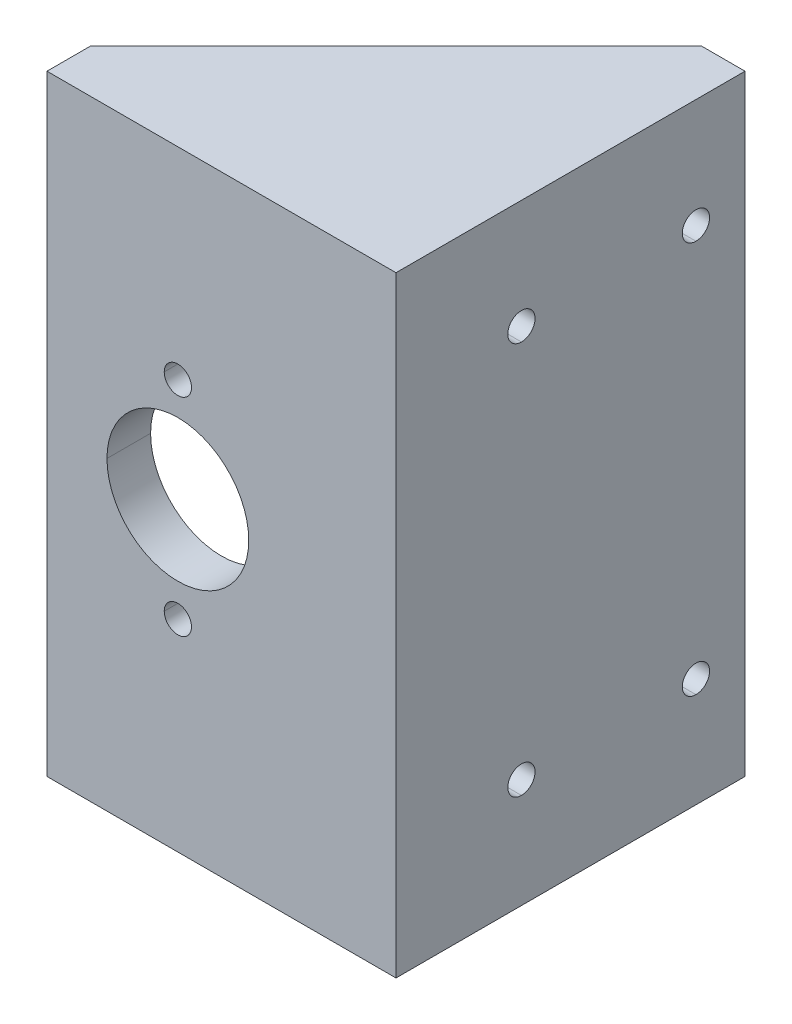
ISO-10303-21;
HEADER;
FILE_DESCRIPTION(('STEP AP214'),'2;1');
FILE_NAME('part.step','',(''),(''),'','','');
FILE_SCHEMA(('AUTOMOTIVE_DESIGN { 1 0 10303 214 1 1 1 1 }'));
ENDSEC;
DATA;
#1=APPLICATION_CONTEXT('core data for automotive mechanical design processes');
#2=APPLICATION_PROTOCOL_DEFINITION('international standard','automotive_design',2000,#1);
#3=PRODUCT_CONTEXT('',#1,'mechanical');
#4=PRODUCT('Part','Part','',(#3));
#5=PRODUCT_RELATED_PRODUCT_CATEGORY('part','',(#4));
#6=PRODUCT_DEFINITION_FORMATION('','',#4);
#7=PRODUCT_DEFINITION_CONTEXT('part definition',#1,'design');
#8=PRODUCT_DEFINITION('design','',#6,#7);
#9=PRODUCT_DEFINITION_SHAPE('','',#8);
#10=(LENGTH_UNIT() NAMED_UNIT(*) SI_UNIT(.MILLI.,.METRE.));
#11=(NAMED_UNIT(*) PLANE_ANGLE_UNIT() SI_UNIT($,.RADIAN.));
#12=(NAMED_UNIT(*) SI_UNIT($,.STERADIAN.) SOLID_ANGLE_UNIT());
#13=UNCERTAINTY_MEASURE_WITH_UNIT(LENGTH_MEASURE(1.E-05),#10,'distance_accuracy_value','');
#14=(GEOMETRIC_REPRESENTATION_CONTEXT(3) GLOBAL_UNCERTAINTY_ASSIGNED_CONTEXT((#13)) GLOBAL_UNIT_ASSIGNED_CONTEXT((#10,
#11,#12)) REPRESENTATION_CONTEXT('',''));
#15=CARTESIAN_POINT('',(0.,0.,0.));
#16=DIRECTION('',(0.,0.,1.));
#17=DIRECTION('',(1.,0.,0.));
#18=AXIS2_PLACEMENT_3D('',#15,#16,#17);
#19=CARTESIAN_POINT('',(38.1,-76.2,25.4));
#20=DIRECTION('',(0.,-1.,0.));
#21=DIRECTION('',(0.,0.,-1.));
#22=AXIS2_PLACEMENT_3D('',#19,#20,#21);
#23=PLANE('',#22);
#24=DIRECTION('',(-1.,0.,0.));
#25=VECTOR('',#24,1.);
#26=CARTESIAN_POINT('',(38.1,-76.2,25.4));
#27=LINE('',#26,#25);
#28=CARTESIAN_POINT('',(-38.1,-76.2000000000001,25.4));
#29=VERTEX_POINT('',#28);
#30=CARTESIAN_POINT('',(38.1,-76.2000000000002,25.4));
#31=VERTEX_POINT('',#30);
#32=EDGE_CURVE('E176',#29,#31,#27,.F.);
#33=ORIENTED_EDGE('',*,*,#32,.T.);
#34=DIRECTION('',(0.,0.,1.));
#35=VECTOR('',#34,1.);
#36=CARTESIAN_POINT('',(38.1,-76.2000000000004,11.7700640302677));
#37=LINE('',#36,#35);
#38=CARTESIAN_POINT('',(38.1,-76.2000000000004,-50.8));
#39=VERTEX_POINT('',#38);
#40=EDGE_CURVE('E179',#39,#31,#37,.T.);
#41=ORIENTED_EDGE('',*,*,#40,.F.);
#42=DIRECTION('',(0.707106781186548,0.,-0.707106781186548));
#43=VECTOR('',#42,1.);
#44=CARTESIAN_POINT('',(-50.8,-76.2000000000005,38.1));
#45=LINE('',#44,#43);
#46=EDGE_CURVE('E174',#39,#29,#45,.F.);
#47=ORIENTED_EDGE('',*,*,#46,.T.);
#48=EDGE_LOOP('',(#33,#41,#47));
#49=FACE_BOUND('',#48,.T.);
#50=ADVANCED_FACE('F16',(#49),#23,.F.);
#51=CARTESIAN_POINT('',(38.1,-63.5,25.4));
#52=DIRECTION('',(-1.,0.,0.));
#53=DIRECTION('',(0.,0.,1.));
#54=AXIS2_PLACEMENT_3D('',#51,#52,#53);
#55=CYLINDRICAL_SURFACE('',#54,12.7);
#56=DIRECTION('',(1.,0.,0.));
#57=VECTOR('',#56,1.);
#58=CARTESIAN_POINT('',(38.1,-63.5,38.1));
#59=LINE('',#58,#57);
#60=CARTESIAN_POINT('',(-50.8,-63.5,38.1));
#61=VERTEX_POINT('',#60);
#62=CARTESIAN_POINT('',(38.1,-63.5,38.1));
#63=VERTEX_POINT('',#62);
#64=EDGE_CURVE('E233',#61,#63,#59,.T.);
#65=ORIENTED_EDGE('',*,*,#64,.T.);
#66=CARTESIAN_POINT('',(38.1,-63.5,25.4));
#67=DIRECTION('',(-1.,0.,0.));
#68=DIRECTION('',(0.,0.,1.));
#69=AXIS2_PLACEMENT_3D('',#66,#67,#68);
#70=CIRCLE('',#69,12.7);
#71=EDGE_CURVE('E191',#31,#63,#70,.T.);
#72=ORIENTED_EDGE('',*,*,#71,.F.);
#73=ORIENTED_EDGE('',*,*,#32,.F.);
#74=CARTESIAN_POINT('',(-38.1,-63.5,25.4));
#75=DIRECTION('',(0.707106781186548,0.,0.707106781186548));
#76=DIRECTION('',(-0.707106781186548,0.,0.707106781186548));
#77=AXIS2_PLACEMENT_3D('',#74,#75,#76);
#78=ELLIPSE('',#77,17.9605122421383,12.7);
#79=EDGE_CURVE('E19',#29,#61,#78,.F.);
#80=ORIENTED_EDGE('',*,*,#79,.T.);
#81=EDGE_LOOP('',(#65,#72,#73,#80));
#82=FACE_BOUND('',#81,.T.);
#83=ADVANCED_FACE('F188',(#82),#55,.F.);
#84=CARTESIAN_POINT('',(38.1,76.1999999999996,-50.8));
#85=DIRECTION('',(0.,1.,0.));
#86=DIRECTION('',(0.,0.,1.));
#87=AXIS2_PLACEMENT_3D('',#84,#85,#86);
#88=PLANE('',#87);
#89=DIRECTION('',(0.,0.,1.));
#90=VECTOR('',#89,1.);
#91=CARTESIAN_POINT('',(38.1,76.1999999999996,11.7700640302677));
#92=LINE('',#91,#90);
#93=CARTESIAN_POINT('',(38.1,76.1999999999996,25.4));
#94=VERTEX_POINT('',#93);
#95=CARTESIAN_POINT('',(38.1,76.1999999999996,-50.8));
#96=VERTEX_POINT('',#95);
#97=EDGE_CURVE('E205',#94,#96,#92,.F.);
#98=ORIENTED_EDGE('',*,*,#97,.F.);
#99=DIRECTION('',(-1.,0.,0.));
#100=VECTOR('',#99,1.);
#101=CARTESIAN_POINT('',(38.1,76.1999999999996,25.4));
#102=LINE('',#101,#100);
#103=CARTESIAN_POINT('',(-38.1,76.1999999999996,25.4));
#104=VERTEX_POINT('',#103);
#105=EDGE_CURVE('E192',#94,#104,#102,.T.);
#106=ORIENTED_EDGE('',*,*,#105,.T.);
#107=DIRECTION('',(0.707106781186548,0.,-0.707106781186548));
#108=VECTOR('',#107,1.);
#109=CARTESIAN_POINT('',(-50.8,76.1999999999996,38.1));
#110=LINE('',#109,#108);
#111=EDGE_CURVE('E350',#104,#96,#110,.T.);
#112=ORIENTED_EDGE('',*,*,#111,.T.);
#113=EDGE_LOOP('',(#98,#106,#112));
#114=FACE_BOUND('',#113,.T.);
#115=ADVANCED_FACE('F427',(#114),#88,.F.);
#116=CARTESIAN_POINT('',(38.1,63.4999999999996,25.4));
#117=DIRECTION('',(-1.,0.,0.));
#118=DIRECTION('',(0.,0.,1.));
#119=AXIS2_PLACEMENT_3D('',#116,#117,#118);
#120=CYLINDRICAL_SURFACE('',#119,12.7);
#121=ORIENTED_EDGE('',*,*,#105,.F.);
#122=CARTESIAN_POINT('',(38.1,63.4999999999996,25.4));
#123=DIRECTION('',(-1.,0.,0.));
#124=DIRECTION('',(0.,0.,1.));
#125=AXIS2_PLACEMENT_3D('',#122,#123,#124);
#126=CIRCLE('',#125,12.7);
#127=CARTESIAN_POINT('',(38.1,63.4999999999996,38.1));
#128=VERTEX_POINT('',#127);
#129=EDGE_CURVE('E200',#128,#94,#126,.T.);
#130=ORIENTED_EDGE('',*,*,#129,.F.);
#131=DIRECTION('',(1.,0.,0.));
#132=VECTOR('',#131,1.);
#133=CARTESIAN_POINT('',(38.1,63.4999999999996,38.1));
#134=LINE('',#133,#132);
#135=CARTESIAN_POINT('',(-50.8,63.4999999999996,38.1));
#136=VERTEX_POINT('',#135);
#137=EDGE_CURVE('E184',#128,#136,#134,.F.);
#138=ORIENTED_EDGE('',*,*,#137,.T.);
#139=CARTESIAN_POINT('',(-38.1,63.4999999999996,25.4));
#140=DIRECTION('',(0.707106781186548,0.,0.707106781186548));
#141=DIRECTION('',(-0.707106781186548,0.,0.707106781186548));
#142=AXIS2_PLACEMENT_3D('',#139,#140,#141);
#143=ELLIPSE('',#142,17.9605122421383,12.7);
#144=EDGE_CURVE('E236',#136,#104,#143,.F.);
#145=ORIENTED_EDGE('',*,*,#144,.T.);
#146=EDGE_LOOP('',(#121,#130,#138,#145));
#147=FACE_BOUND('',#146,.T.);
#148=ADVANCED_FACE('F422',(#147),#120,.F.);
#149=CARTESIAN_POINT('',(38.1,63.4999999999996,38.1));
#150=DIRECTION('',(0.,0.,1.));
#151=DIRECTION('',(1.,0.,0.));
#152=AXIS2_PLACEMENT_3D('',#149,#150,#151);
#153=PLANE('',#152);
#154=CARTESIAN_POINT('',(-12.7,-30.1625000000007,38.1));
#155=DIRECTION('',(0.,0.,1.));
#156=DIRECTION('',(1.,0.,0.));
#157=AXIS2_PLACEMENT_3D('',#154,#155,#156);
#158=CIRCLE('',#157,3.96875);
#159=CARTESIAN_POINT('',(-16.66875,-30.1625000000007,38.1));
#160=VERTEX_POINT('',#159);
#161=CARTESIAN_POINT('',(-8.73125,-30.1625000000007,38.1));
#162=VERTEX_POINT('',#161);
#163=EDGE_CURVE('E344',#160,#162,#158,.T.);
#164=ORIENTED_EDGE('',*,*,#163,.T.);
#165=CARTESIAN_POINT('',(-12.7,-30.1625000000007,38.1));
#166=DIRECTION('',(0.,0.,1.));
#167=DIRECTION('',(1.,0.,0.));
#168=AXIS2_PLACEMENT_3D('',#165,#166,#167);
#169=CIRCLE('',#168,3.96875);
#170=EDGE_CURVE('E217',#162,#160,#169,.T.);
#171=ORIENTED_EDGE('',*,*,#170,.T.);
#172=EDGE_LOOP('',(#164,#171));
#173=FACE_BOUND('',#172,.T.);
#174=CARTESIAN_POINT('',(-12.7,30.1624999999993,38.1));
#175=DIRECTION('',(0.,0.,1.));
#176=DIRECTION('',(1.,0.,0.));
#177=AXIS2_PLACEMENT_3D('',#174,#175,#176);
#178=CIRCLE('',#177,3.96875);
#179=CARTESIAN_POINT('',(-16.66875,30.1624999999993,38.1));
#180=VERTEX_POINT('',#179);
#181=CARTESIAN_POINT('',(-8.73125,30.1624999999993,38.1));
#182=VERTEX_POINT('',#181);
#183=EDGE_CURVE('E338',#180,#182,#178,.T.);
#184=ORIENTED_EDGE('',*,*,#183,.T.);
#185=CARTESIAN_POINT('',(-12.7,30.1624999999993,38.1));
#186=DIRECTION('',(0.,0.,1.));
#187=DIRECTION('',(1.,0.,0.));
#188=AXIS2_PLACEMENT_3D('',#185,#186,#187);
#189=CIRCLE('',#188,3.96875);
#190=EDGE_CURVE('E341',#182,#180,#189,.T.);
#191=ORIENTED_EDGE('',*,*,#190,.T.);
#192=EDGE_LOOP('',(#184,#191));
#193=FACE_BOUND('',#192,.T.);
#194=CARTESIAN_POINT('',(-12.7,-7.21911419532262E-13,38.1));
#195=DIRECTION('',(0.,0.,1.));
#196=DIRECTION('',(1.,0.,0.));
#197=AXIS2_PLACEMENT_3D('',#194,#195,#196);
#198=CIRCLE('',#197,20.6375);
#199=CARTESIAN_POINT('',(7.9375,-7.24438700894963E-13,38.1));
#200=VERTEX_POINT('',#199);
#201=CARTESIAN_POINT('',(-33.3375,-7.19384138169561E-13,38.1));
#202=VERTEX_POINT('',#201);
#203=EDGE_CURVE('E335',#200,#202,#198,.T.);
#204=ORIENTED_EDGE('',*,*,#203,.T.);
#205=CARTESIAN_POINT('',(-12.7,-7.21911419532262E-13,38.1));
#206=DIRECTION('',(0.,0.,1.));
#207=DIRECTION('',(1.,0.,0.));
#208=AXIS2_PLACEMENT_3D('',#205,#206,#207);
#209=CIRCLE('',#208,20.6375);
#210=EDGE_CURVE('E332',#202,#200,#209,.T.);
#211=ORIENTED_EDGE('',*,*,#210,.T.);
#212=EDGE_LOOP('',(#204,#211));
#213=FACE_BOUND('',#212,.T.);
#214=ORIENTED_EDGE('',*,*,#137,.F.);
#215=DIRECTION('',(0.,1.,0.));
#216=VECTOR('',#215,1.);
#217=CARTESIAN_POINT('',(38.1,-3.60955709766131E-13,38.1));
#218=LINE('',#217,#216);
#219=EDGE_CURVE('E198',#63,#128,#218,.T.);
#220=ORIENTED_EDGE('',*,*,#219,.F.);
#221=ORIENTED_EDGE('',*,*,#64,.F.);
#222=DIRECTION('',(0.,1.,0.));
#223=VECTOR('',#222,1.);
#224=CARTESIAN_POINT('',(-50.8,114.3,38.1));
#225=LINE('',#224,#223);
#226=EDGE_CURVE('E212',#61,#136,#225,.T.);
#227=ORIENTED_EDGE('',*,*,#226,.T.);
#228=EDGE_LOOP('',(#214,#220,#221,#227));
#229=FACE_BOUND('',#228,.T.);
#230=ADVANCED_FACE('F419',(#173,#193,#213,#229),#153,.F.);
#231=CARTESIAN_POINT('',(-50.8,114.3,38.1));
#232=DIRECTION('',(0.707106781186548,0.,0.707106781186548));
#233=DIRECTION('',(0.707106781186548,0.,-0.707106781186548));
#234=AXIS2_PLACEMENT_3D('',#231,#232,#233);
#235=PLANE('',#234);
#236=ORIENTED_EDGE('',*,*,#46,.F.);
#237=DIRECTION('',(0.,1.,0.));
#238=VECTOR('',#237,1.);
#239=CARTESIAN_POINT('',(38.1,-76.2,-50.8));
#240=LINE('',#239,#238);
#241=CARTESIAN_POINT('',(38.1,-88.9,-50.8));
#242=VERTEX_POINT('',#241);
#243=EDGE_CURVE('E258',#242,#39,#240,.T.);
#244=ORIENTED_EDGE('',*,*,#243,.F.);
#245=DIRECTION('',(0.707106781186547,0.,-0.707106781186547));
#246=VECTOR('',#245,1.);
#247=CARTESIAN_POINT('',(-50.8,-88.9,38.1));
#248=LINE('',#247,#246);
#249=CARTESIAN_POINT('',(-50.8,-88.9,38.1));
#250=VERTEX_POINT('',#249);
#251=EDGE_CURVE('E239',#250,#242,#248,.T.);
#252=ORIENTED_EDGE('',*,*,#251,.F.);
#253=DIRECTION('',(0.,1.,0.));
#254=VECTOR('',#253,1.);
#255=CARTESIAN_POINT('',(-50.8,114.3,38.1));
#256=LINE('',#255,#254);
#257=EDGE_CURVE('E196',#250,#61,#256,.T.);
#258=ORIENTED_EDGE('',*,*,#257,.T.);
#259=ORIENTED_EDGE('',*,*,#79,.F.);
#260=EDGE_LOOP('',(#236,#244,#252,#258,#259));
#261=FACE_BOUND('',#260,.T.);
#262=ADVANCED_FACE('F194',(#261),#235,.F.);
#263=CARTESIAN_POINT('',(38.1,-3.60955709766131E-13,11.7700640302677));
#264=DIRECTION('',(-1.,0.,0.));
#265=DIRECTION('',(0.,0.,1.));
#266=AXIS2_PLACEMENT_3D('',#263,#264,#265);
#267=PLANE('',#266);
#268=ORIENTED_EDGE('',*,*,#40,.T.);
#269=ORIENTED_EDGE('',*,*,#71,.T.);
#270=ORIENTED_EDGE('',*,*,#219,.T.);
#271=ORIENTED_EDGE('',*,*,#129,.T.);
#272=ORIENTED_EDGE('',*,*,#97,.T.);
#273=DIRECTION('',(0.,1.,0.));
#274=VECTOR('',#273,1.);
#275=CARTESIAN_POINT('',(38.1,-76.2,-50.8));
#276=LINE('',#275,#274);
#277=EDGE_CURVE('E255',#39,#96,#276,.T.);
#278=ORIENTED_EDGE('',*,*,#277,.F.);
#279=EDGE_LOOP('',(#268,#269,#270,#271,#272,#278));
#280=FACE_BOUND('',#279,.T.);
#281=CARTESIAN_POINT('',(38.1,-57.15,-36.5125));
#282=DIRECTION('',(-1.,0.,0.));
#283=DIRECTION('',(0.,0.,1.));
#284=AXIS2_PLACEMENT_3D('',#281,#282,#283);
#285=CIRCLE('',#284,3.96875);
#286=CARTESIAN_POINT('',(38.1,-61.11875,-36.5125));
#287=VERTEX_POINT('',#286);
#288=CARTESIAN_POINT('',(38.1,-53.18125,-36.5125));
#289=VERTEX_POINT('',#288);
#290=EDGE_CURVE('E308',#287,#289,#285,.F.);
#291=ORIENTED_EDGE('',*,*,#290,.T.);
#292=CARTESIAN_POINT('',(38.1,-57.15,-36.5125));
#293=DIRECTION('',(-1.,0.,0.));
#294=DIRECTION('',(0.,0.,1.));
#295=AXIS2_PLACEMENT_3D('',#292,#293,#294);
#296=CIRCLE('',#295,3.96875);
#297=EDGE_CURVE('E311',#289,#287,#296,.F.);
#298=ORIENTED_EDGE('',*,*,#297,.T.);
#299=EDGE_LOOP('',(#291,#298));
#300=FACE_BOUND('',#299,.T.);
#301=CARTESIAN_POINT('',(38.1,-57.15,14.2875));
#302=DIRECTION('',(-1.,0.,0.));
#303=DIRECTION('',(0.,0.,1.));
#304=AXIS2_PLACEMENT_3D('',#301,#302,#303);
#305=CIRCLE('',#304,3.96875);
#306=CARTESIAN_POINT('',(38.1,-61.11875,14.2875));
#307=VERTEX_POINT('',#306);
#308=CARTESIAN_POINT('',(38.1,-53.18125,14.2875));
#309=VERTEX_POINT('',#308);
#310=EDGE_CURVE('E314',#307,#309,#305,.F.);
#311=ORIENTED_EDGE('',*,*,#310,.T.);
#312=CARTESIAN_POINT('',(38.1,-57.15,14.2875));
#313=DIRECTION('',(-1.,0.,0.));
#314=DIRECTION('',(0.,0.,1.));
#315=AXIS2_PLACEMENT_3D('',#312,#313,#314);
#316=CIRCLE('',#315,3.96875);
#317=EDGE_CURVE('E317',#309,#307,#316,.F.);
#318=ORIENTED_EDGE('',*,*,#317,.T.);
#319=EDGE_LOOP('',(#311,#318));
#320=FACE_BOUND('',#319,.T.);
#321=CARTESIAN_POINT('',(38.1,57.1500000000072,14.2875));
#322=DIRECTION('',(-1.,0.,0.));
#323=DIRECTION('',(0.,0.,1.));
#324=AXIS2_PLACEMENT_3D('',#321,#322,#323);
#325=CIRCLE('',#324,3.96875);
#326=CARTESIAN_POINT('',(38.1,53.1812500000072,14.2875));
#327=VERTEX_POINT('',#326);
#328=CARTESIAN_POINT('',(38.1,61.1187500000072,14.2875));
#329=VERTEX_POINT('',#328);
#330=EDGE_CURVE('E320',#327,#329,#325,.F.);
#331=ORIENTED_EDGE('',*,*,#330,.T.);
#332=CARTESIAN_POINT('',(38.1,57.1500000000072,14.2875));
#333=DIRECTION('',(-1.,0.,0.));
#334=DIRECTION('',(0.,0.,1.));
#335=AXIS2_PLACEMENT_3D('',#332,#333,#334);
#336=CIRCLE('',#335,3.96875);
#337=EDGE_CURVE('E323',#329,#327,#336,.F.);
#338=ORIENTED_EDGE('',*,*,#337,.T.);
#339=EDGE_LOOP('',(#331,#338));
#340=FACE_BOUND('',#339,.T.);
#341=CARTESIAN_POINT('',(38.1,57.1500000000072,-36.5125));
#342=DIRECTION('',(-1.,0.,0.));
#343=DIRECTION('',(0.,0.,1.));
#344=AXIS2_PLACEMENT_3D('',#341,#342,#343);
#345=CIRCLE('',#344,3.96875);
#346=CARTESIAN_POINT('',(38.1,53.1812500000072,-36.5125));
#347=VERTEX_POINT('',#346);
#348=CARTESIAN_POINT('',(38.1,61.1187500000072,-36.5125));
#349=VERTEX_POINT('',#348);
#350=EDGE_CURVE('E326',#347,#349,#345,.F.);
#351=ORIENTED_EDGE('',*,*,#350,.T.);
#352=CARTESIAN_POINT('',(38.1,57.1500000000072,-36.5125));
#353=DIRECTION('',(-1.,0.,0.));
#354=DIRECTION('',(0.,0.,1.));
#355=AXIS2_PLACEMENT_3D('',#352,#353,#354);
#356=CIRCLE('',#355,3.96875);
#357=EDGE_CURVE('E329',#349,#347,#356,.F.);
#358=ORIENTED_EDGE('',*,*,#357,.T.);
#359=EDGE_LOOP('',(#351,#358));
#360=FACE_BOUND('',#359,.T.);
#361=ADVANCED_FACE('F424',(#280,#300,#320,#340,#360),#267,.T.);
#362=CARTESIAN_POINT('',(-50.8,114.3,38.1));
#363=DIRECTION('',(0.707106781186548,0.,0.707106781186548));
#364=DIRECTION('',(0.707106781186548,0.,-0.707106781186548));
#365=AXIS2_PLACEMENT_3D('',#362,#363,#364);
#366=PLANE('',#365);
#367=DIRECTION('',(0.,1.,0.));
#368=VECTOR('',#367,1.);
#369=CARTESIAN_POINT('',(-50.8,114.3,38.1));
#370=LINE('',#369,#368);
#371=CARTESIAN_POINT('',(-50.8,88.9,38.1));
#372=VERTEX_POINT('',#371);
#373=EDGE_CURVE('E215',#136,#372,#370,.T.);
#374=ORIENTED_EDGE('',*,*,#373,.T.);
#375=DIRECTION('',(0.707106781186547,0.,-0.707106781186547));
#376=VECTOR('',#375,1.);
#377=CARTESIAN_POINT('',(-50.8,88.9,38.1));
#378=LINE('',#377,#376);
#379=CARTESIAN_POINT('',(38.1,88.9,-50.8));
#380=VERTEX_POINT('',#379);
#381=EDGE_CURVE('E223',#372,#380,#378,.T.);
#382=ORIENTED_EDGE('',*,*,#381,.T.);
#383=DIRECTION('',(0.,1.,0.));
#384=VECTOR('',#383,1.);
#385=CARTESIAN_POINT('',(38.1,-76.2,-50.8));
#386=LINE('',#385,#384);
#387=EDGE_CURVE('E247',#96,#380,#386,.T.);
#388=ORIENTED_EDGE('',*,*,#387,.F.);
#389=ORIENTED_EDGE('',*,*,#111,.F.);
#390=ORIENTED_EDGE('',*,*,#144,.F.);
#391=EDGE_LOOP('',(#374,#382,#388,#389,#390));
#392=FACE_BOUND('',#391,.T.);
#393=ADVANCED_FACE('F407',(#392),#366,.F.);
#394=CARTESIAN_POINT('',(-50.8,114.3,50.8));
#395=DIRECTION('',(1.,0.,0.));
#396=DIRECTION('',(0.,0.,-1.));
#397=AXIS2_PLACEMENT_3D('',#394,#395,#396);
#398=PLANE('',#397);
#399=DIRECTION('',(0.,1.,0.));
#400=VECTOR('',#399,1.);
#401=CARTESIAN_POINT('',(-50.8,-76.2,50.8));
#402=LINE('',#401,#400);
#403=CARTESIAN_POINT('',(-50.8,88.9,50.8));
#404=VERTEX_POINT('',#403);
#405=CARTESIAN_POINT('',(-50.8,-88.9,50.8));
#406=VERTEX_POINT('',#405);
#407=EDGE_CURVE('E229',#404,#406,#402,.F.);
#408=ORIENTED_EDGE('',*,*,#407,.F.);
#409=DIRECTION('',(0.,0.,-1.));
#410=VECTOR('',#409,1.);
#411=CARTESIAN_POINT('',(-50.8,88.9,7.62000000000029));
#412=LINE('',#411,#410);
#413=EDGE_CURVE('E220',#404,#372,#412,.T.);
#414=ORIENTED_EDGE('',*,*,#413,.T.);
#415=ORIENTED_EDGE('',*,*,#373,.F.);
#416=ORIENTED_EDGE('',*,*,#226,.F.);
#417=ORIENTED_EDGE('',*,*,#257,.F.);
#418=DIRECTION('',(0.,0.,-1.));
#419=VECTOR('',#418,1.);
#420=CARTESIAN_POINT('',(-50.8,-88.9,50.8));
#421=LINE('',#420,#419);
#422=EDGE_CURVE('E241',#406,#250,#421,.T.);
#423=ORIENTED_EDGE('',*,*,#422,.F.);
#424=EDGE_LOOP('',(#408,#414,#415,#416,#417,#423));
#425=FACE_BOUND('',#424,.T.);
#426=ADVANCED_FACE('F412',(#425),#398,.F.);
#427=CARTESIAN_POINT('',(-12.7,-30.1625000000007,50.8));
#428=DIRECTION('',(0.,0.,1.));
#429=DIRECTION('',(1.,0.,0.));
#430=AXIS2_PLACEMENT_3D('',#427,#428,#429);
#431=CYLINDRICAL_SURFACE('',#430,3.96875);
#432=CARTESIAN_POINT('',(-12.7,-30.1625000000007,50.8));
#433=DIRECTION('',(0.,0.,1.));
#434=DIRECTION('',(1.,0.,0.));
#435=AXIS2_PLACEMENT_3D('',#432,#433,#434);
#436=CIRCLE('',#435,3.96875);
#437=CARTESIAN_POINT('',(-16.66875,-30.1625000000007,50.8));
#438=VERTEX_POINT('',#437);
#439=CARTESIAN_POINT('',(-8.73125,-30.1625000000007,50.8));
#440=VERTEX_POINT('',#439);
#441=EDGE_CURVE('E305',#438,#440,#436,.F.);
#442=ORIENTED_EDGE('',*,*,#441,.F.);
#443=DIRECTION('',(0.,0.,1.));
#444=VECTOR('',#443,1.);
#445=CARTESIAN_POINT('',(-16.66875,-30.1625000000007,50.8));
#446=LINE('',#445,#444);
#447=EDGE_CURVE('E346',#438,#160,#446,.F.);
#448=ORIENTED_EDGE('',*,*,#447,.T.);
#449=ORIENTED_EDGE('',*,*,#170,.F.);
#450=DIRECTION('',(0.,0.,1.));
#451=VECTOR('',#450,1.);
#452=CARTESIAN_POINT('',(-8.73125,-30.1625000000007,50.8));
#453=LINE('',#452,#451);
#454=EDGE_CURVE('E343',#162,#440,#453,.T.);
#455=ORIENTED_EDGE('',*,*,#454,.T.);
#456=EDGE_LOOP('',(#442,#448,#449,#455));
#457=FACE_BOUND('',#456,.T.);
#458=ADVANCED_FACE('F501',(#457),#431,.F.);
#459=CARTESIAN_POINT('',(-12.7,-30.1625000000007,50.8));
#460=DIRECTION('',(0.,0.,1.));
#461=DIRECTION('',(1.,0.,0.));
#462=AXIS2_PLACEMENT_3D('',#459,#460,#461);
#463=CYLINDRICAL_SURFACE('',#462,3.96875);
#464=ORIENTED_EDGE('',*,*,#163,.F.);
#465=ORIENTED_EDGE('',*,*,#447,.F.);
#466=CARTESIAN_POINT('',(-12.7,-30.1625000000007,50.8));
#467=DIRECTION('',(0.,0.,1.));
#468=DIRECTION('',(1.,0.,0.));
#469=AXIS2_PLACEMENT_3D('',#466,#467,#468);
#470=CIRCLE('',#469,3.96875);
#471=EDGE_CURVE('E302',#440,#438,#470,.F.);
#472=ORIENTED_EDGE('',*,*,#471,.F.);
#473=ORIENTED_EDGE('',*,*,#454,.F.);
#474=EDGE_LOOP('',(#464,#465,#472,#473));
#475=FACE_BOUND('',#474,.T.);
#476=ADVANCED_FACE('F497',(#475),#463,.F.);
#477=CARTESIAN_POINT('',(-12.7,30.1624999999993,50.8));
#478=DIRECTION('',(0.,0.,1.));
#479=DIRECTION('',(1.,0.,0.));
#480=AXIS2_PLACEMENT_3D('',#477,#478,#479);
#481=CYLINDRICAL_SURFACE('',#480,3.96875);
#482=CARTESIAN_POINT('',(-12.7,30.1624999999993,50.8));
#483=DIRECTION('',(0.,0.,1.));
#484=DIRECTION('',(1.,0.,0.));
#485=AXIS2_PLACEMENT_3D('',#482,#483,#484);
#486=CIRCLE('',#485,3.96875);
#487=CARTESIAN_POINT('',(-16.66875,30.1624999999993,50.8));
#488=VERTEX_POINT('',#487);
#489=CARTESIAN_POINT('',(-8.73125,30.1624999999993,50.8));
#490=VERTEX_POINT('',#489);
#491=EDGE_CURVE('E299',#488,#490,#486,.F.);
#492=ORIENTED_EDGE('',*,*,#491,.F.);
#493=DIRECTION('',(0.,0.,1.));
#494=VECTOR('',#493,1.);
#495=CARTESIAN_POINT('',(-16.66875,30.1624999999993,50.8));
#496=LINE('',#495,#494);
#497=EDGE_CURVE('E340',#488,#180,#496,.F.);
#498=ORIENTED_EDGE('',*,*,#497,.T.);
#499=ORIENTED_EDGE('',*,*,#190,.F.);
#500=DIRECTION('',(0.,0.,1.));
#501=VECTOR('',#500,1.);
#502=CARTESIAN_POINT('',(-8.73125,30.1624999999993,50.8));
#503=LINE('',#502,#501);
#504=EDGE_CURVE('E337',#182,#490,#503,.T.);
#505=ORIENTED_EDGE('',*,*,#504,.T.);
#506=EDGE_LOOP('',(#492,#498,#499,#505));
#507=FACE_BOUND('',#506,.T.);
#508=ADVANCED_FACE('F493',(#507),#481,.F.);
#509=CARTESIAN_POINT('',(-12.7,30.1624999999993,50.8));
#510=DIRECTION('',(0.,0.,1.));
#511=DIRECTION('',(1.,0.,0.));
#512=AXIS2_PLACEMENT_3D('',#509,#510,#511);
#513=CYLINDRICAL_SURFACE('',#512,3.96875);
#514=ORIENTED_EDGE('',*,*,#183,.F.);
#515=ORIENTED_EDGE('',*,*,#497,.F.);
#516=CARTESIAN_POINT('',(-12.7,30.1624999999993,50.8));
#517=DIRECTION('',(0.,0.,1.));
#518=DIRECTION('',(1.,0.,0.));
#519=AXIS2_PLACEMENT_3D('',#516,#517,#518);
#520=CIRCLE('',#519,3.96875);
#521=EDGE_CURVE('E296',#490,#488,#520,.F.);
#522=ORIENTED_EDGE('',*,*,#521,.F.);
#523=ORIENTED_EDGE('',*,*,#504,.F.);
#524=EDGE_LOOP('',(#514,#515,#522,#523));
#525=FACE_BOUND('',#524,.T.);
#526=ADVANCED_FACE('F489',(#525),#513,.F.);
#527=CARTESIAN_POINT('',(-12.7,-7.21911419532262E-13,50.8));
#528=DIRECTION('',(0.,0.,1.));
#529=DIRECTION('',(1.,0.,0.));
#530=AXIS2_PLACEMENT_3D('',#527,#528,#529);
#531=CYLINDRICAL_SURFACE('',#530,20.6375);
#532=CARTESIAN_POINT('',(-12.7,-7.21911419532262E-13,50.8));
#533=DIRECTION('',(0.,0.,1.));
#534=DIRECTION('',(1.,0.,0.));
#535=AXIS2_PLACEMENT_3D('',#532,#533,#534);
#536=CIRCLE('',#535,20.6375);
#537=CARTESIAN_POINT('',(-33.3375,-7.19384138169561E-13,50.8));
#538=VERTEX_POINT('',#537);
#539=CARTESIAN_POINT('',(7.9375,-7.24438700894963E-13,50.8));
#540=VERTEX_POINT('',#539);
#541=EDGE_CURVE('E293',#538,#540,#536,.F.);
#542=ORIENTED_EDGE('',*,*,#541,.F.);
#543=DIRECTION('',(0.,0.,1.));
#544=VECTOR('',#543,1.);
#545=CARTESIAN_POINT('',(-33.3375,-7.19384138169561E-13,50.8));
#546=LINE('',#545,#544);
#547=EDGE_CURVE('E334',#538,#202,#546,.F.);
#548=ORIENTED_EDGE('',*,*,#547,.T.);
#549=ORIENTED_EDGE('',*,*,#203,.F.);
#550=DIRECTION('',(0.,0.,1.));
#551=VECTOR('',#550,1.);
#552=CARTESIAN_POINT('',(7.9375,-7.21911419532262E-13,50.8));
#553=LINE('',#552,#551);
#554=EDGE_CURVE('E331',#200,#540,#553,.T.);
#555=ORIENTED_EDGE('',*,*,#554,.T.);
#556=EDGE_LOOP('',(#542,#548,#549,#555));
#557=FACE_BOUND('',#556,.T.);
#558=ADVANCED_FACE('F485',(#557),#531,.F.);
#559=CARTESIAN_POINT('',(-12.7,-7.21911419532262E-13,50.8));
#560=DIRECTION('',(0.,0.,1.));
#561=DIRECTION('',(1.,0.,0.));
#562=AXIS2_PLACEMENT_3D('',#559,#560,#561);
#563=CYLINDRICAL_SURFACE('',#562,20.6375);
#564=ORIENTED_EDGE('',*,*,#210,.F.);
#565=ORIENTED_EDGE('',*,*,#547,.F.);
#566=CARTESIAN_POINT('',(-12.7,-7.21911419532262E-13,50.8));
#567=DIRECTION('',(0.,0.,1.));
#568=DIRECTION('',(1.,0.,0.));
#569=AXIS2_PLACEMENT_3D('',#566,#567,#568);
#570=CIRCLE('',#569,20.6375);
#571=EDGE_CURVE('E290',#540,#538,#570,.F.);
#572=ORIENTED_EDGE('',*,*,#571,.F.);
#573=ORIENTED_EDGE('',*,*,#554,.F.);
#574=EDGE_LOOP('',(#564,#565,#572,#573));
#575=FACE_BOUND('',#574,.T.);
#576=ADVANCED_FACE('F481',(#575),#563,.F.);
#577=CARTESIAN_POINT('',(44.45,57.1500000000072,-36.5125));
#578=DIRECTION('',(-1.,0.,0.));
#579=DIRECTION('',(0.,0.,1.));
#580=AXIS2_PLACEMENT_3D('',#577,#578,#579);
#581=CYLINDRICAL_SURFACE('',#580,3.96875);
#582=ORIENTED_EDGE('',*,*,#357,.F.);
#583=DIRECTION('',(-1.,0.,0.));
#584=VECTOR('',#583,1.);
#585=CARTESIAN_POINT('',(44.45,61.1187500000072,-36.5125));
#586=LINE('',#585,#584);
#587=CARTESIAN_POINT('',(50.8,61.1187500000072,-36.5125));
#588=VERTEX_POINT('',#587);
#589=EDGE_CURVE('E328',#349,#588,#586,.F.);
#590=ORIENTED_EDGE('',*,*,#589,.T.);
#591=CARTESIAN_POINT('',(50.8,57.1500000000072,-36.5125));
#592=DIRECTION('',(-1.,0.,0.));
#593=DIRECTION('',(0.,0.,1.));
#594=AXIS2_PLACEMENT_3D('',#591,#592,#593);
#595=CIRCLE('',#594,3.96875);
#596=CARTESIAN_POINT('',(50.8,53.1812500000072,-36.5125));
#597=VERTEX_POINT('',#596);
#598=EDGE_CURVE('E287',#597,#588,#595,.T.);
#599=ORIENTED_EDGE('',*,*,#598,.F.);
#600=DIRECTION('',(-1.,0.,0.));
#601=VECTOR('',#600,1.);
#602=CARTESIAN_POINT('',(44.45,53.1812500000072,-36.5125));
#603=LINE('',#602,#601);
#604=EDGE_CURVE('E325',#597,#347,#603,.T.);
#605=ORIENTED_EDGE('',*,*,#604,.T.);
#606=EDGE_LOOP('',(#582,#590,#599,#605));
#607=FACE_BOUND('',#606,.T.);
#608=ADVANCED_FACE('F477',(#607),#581,.F.);
#609=CARTESIAN_POINT('',(44.45,57.1500000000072,-36.5125));
#610=DIRECTION('',(-1.,0.,0.));
#611=DIRECTION('',(0.,0.,1.));
#612=AXIS2_PLACEMENT_3D('',#609,#610,#611);
#613=CYLINDRICAL_SURFACE('',#612,3.96875);
#614=CARTESIAN_POINT('',(50.8,57.1500000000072,-36.5125));
#615=DIRECTION('',(-1.,0.,0.));
#616=DIRECTION('',(0.,0.,1.));
#617=AXIS2_PLACEMENT_3D('',#614,#615,#616);
#618=CIRCLE('',#617,3.96875);
#619=EDGE_CURVE('E284',#588,#597,#618,.T.);
#620=ORIENTED_EDGE('',*,*,#619,.F.);
#621=ORIENTED_EDGE('',*,*,#589,.F.);
#622=ORIENTED_EDGE('',*,*,#350,.F.);
#623=ORIENTED_EDGE('',*,*,#604,.F.);
#624=EDGE_LOOP('',(#620,#621,#622,#623));
#625=FACE_BOUND('',#624,.T.);
#626=ADVANCED_FACE('F473',(#625),#613,.F.);
#627=CARTESIAN_POINT('',(44.45,57.1500000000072,14.2875));
#628=DIRECTION('',(-1.,0.,0.));
#629=DIRECTION('',(0.,0.,1.));
#630=AXIS2_PLACEMENT_3D('',#627,#628,#629);
#631=CYLINDRICAL_SURFACE('',#630,3.96875);
#632=ORIENTED_EDGE('',*,*,#337,.F.);
#633=DIRECTION('',(-1.,0.,0.));
#634=VECTOR('',#633,1.);
#635=CARTESIAN_POINT('',(44.45,61.1187500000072,14.2875));
#636=LINE('',#635,#634);
#637=CARTESIAN_POINT('',(50.8,61.1187500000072,14.2875));
#638=VERTEX_POINT('',#637);
#639=EDGE_CURVE('E322',#329,#638,#636,.F.);
#640=ORIENTED_EDGE('',*,*,#639,.T.);
#641=CARTESIAN_POINT('',(50.8,57.1500000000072,14.2875));
#642=DIRECTION('',(-1.,0.,0.));
#643=DIRECTION('',(0.,0.,1.));
#644=AXIS2_PLACEMENT_3D('',#641,#642,#643);
#645=CIRCLE('',#644,3.96875);
#646=CARTESIAN_POINT('',(50.8,53.1812500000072,14.2875));
#647=VERTEX_POINT('',#646);
#648=EDGE_CURVE('E281',#647,#638,#645,.T.);
#649=ORIENTED_EDGE('',*,*,#648,.F.);
#650=DIRECTION('',(-1.,0.,0.));
#651=VECTOR('',#650,1.);
#652=CARTESIAN_POINT('',(44.45,53.1812500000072,14.2875));
#653=LINE('',#652,#651);
#654=EDGE_CURVE('E319',#647,#327,#653,.T.);
#655=ORIENTED_EDGE('',*,*,#654,.T.);
#656=EDGE_LOOP('',(#632,#640,#649,#655));
#657=FACE_BOUND('',#656,.T.);
#658=ADVANCED_FACE('F469',(#657),#631,.F.);
#659=CARTESIAN_POINT('',(44.45,57.1500000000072,14.2875));
#660=DIRECTION('',(-1.,0.,0.));
#661=DIRECTION('',(0.,0.,1.));
#662=AXIS2_PLACEMENT_3D('',#659,#660,#661);
#663=CYLINDRICAL_SURFACE('',#662,3.96875);
#664=CARTESIAN_POINT('',(50.8,57.1500000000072,14.2875));
#665=DIRECTION('',(-1.,0.,0.));
#666=DIRECTION('',(0.,0.,1.));
#667=AXIS2_PLACEMENT_3D('',#664,#665,#666);
#668=CIRCLE('',#667,3.96875);
#669=EDGE_CURVE('E278',#638,#647,#668,.T.);
#670=ORIENTED_EDGE('',*,*,#669,.F.);
#671=ORIENTED_EDGE('',*,*,#639,.F.);
#672=ORIENTED_EDGE('',*,*,#330,.F.);
#673=ORIENTED_EDGE('',*,*,#654,.F.);
#674=EDGE_LOOP('',(#670,#671,#672,#673));
#675=FACE_BOUND('',#674,.T.);
#676=ADVANCED_FACE('F465',(#675),#663,.F.);
#677=CARTESIAN_POINT('',(44.45,-57.15,14.2875));
#678=DIRECTION('',(-1.,0.,0.));
#679=DIRECTION('',(0.,0.,1.));
#680=AXIS2_PLACEMENT_3D('',#677,#678,#679);
#681=CYLINDRICAL_SURFACE('',#680,3.96875);
#682=ORIENTED_EDGE('',*,*,#317,.F.);
#683=DIRECTION('',(-1.,0.,0.));
#684=VECTOR('',#683,1.);
#685=CARTESIAN_POINT('',(44.45,-53.18125,14.2875));
#686=LINE('',#685,#684);
#687=CARTESIAN_POINT('',(50.8,-53.18125,14.2875));
#688=VERTEX_POINT('',#687);
#689=EDGE_CURVE('E316',#309,#688,#686,.F.);
#690=ORIENTED_EDGE('',*,*,#689,.T.);
#691=CARTESIAN_POINT('',(50.8,-57.15,14.2875));
#692=DIRECTION('',(-1.,0.,0.));
#693=DIRECTION('',(0.,0.,1.));
#694=AXIS2_PLACEMENT_3D('',#691,#692,#693);
#695=CIRCLE('',#694,3.96875);
#696=CARTESIAN_POINT('',(50.8,-61.11875,14.2875));
#697=VERTEX_POINT('',#696);
#698=EDGE_CURVE('E275',#697,#688,#695,.T.);
#699=ORIENTED_EDGE('',*,*,#698,.F.);
#700=DIRECTION('',(-1.,0.,0.));
#701=VECTOR('',#700,1.);
#702=CARTESIAN_POINT('',(44.45,-61.11875,14.2875));
#703=LINE('',#702,#701);
#704=EDGE_CURVE('E313',#697,#307,#703,.T.);
#705=ORIENTED_EDGE('',*,*,#704,.T.);
#706=EDGE_LOOP('',(#682,#690,#699,#705));
#707=FACE_BOUND('',#706,.T.);
#708=ADVANCED_FACE('F461',(#707),#681,.F.);
#709=CARTESIAN_POINT('',(44.45,-57.15,14.2875));
#710=DIRECTION('',(-1.,0.,0.));
#711=DIRECTION('',(0.,0.,1.));
#712=AXIS2_PLACEMENT_3D('',#709,#710,#711);
#713=CYLINDRICAL_SURFACE('',#712,3.96875);
#714=CARTESIAN_POINT('',(50.8,-57.15,14.2875));
#715=DIRECTION('',(-1.,0.,0.));
#716=DIRECTION('',(0.,0.,1.));
#717=AXIS2_PLACEMENT_3D('',#714,#715,#716);
#718=CIRCLE('',#717,3.96875);
#719=EDGE_CURVE('E272',#688,#697,#718,.T.);
#720=ORIENTED_EDGE('',*,*,#719,.F.);
#721=ORIENTED_EDGE('',*,*,#689,.F.);
#722=ORIENTED_EDGE('',*,*,#310,.F.);
#723=ORIENTED_EDGE('',*,*,#704,.F.);
#724=EDGE_LOOP('',(#720,#721,#722,#723));
#725=FACE_BOUND('',#724,.T.);
#726=ADVANCED_FACE('F457',(#725),#713,.F.);
#727=CARTESIAN_POINT('',(44.45,-57.15,-36.5125));
#728=DIRECTION('',(-1.,0.,0.));
#729=DIRECTION('',(0.,0.,1.));
#730=AXIS2_PLACEMENT_3D('',#727,#728,#729);
#731=CYLINDRICAL_SURFACE('',#730,3.96875);
#732=ORIENTED_EDGE('',*,*,#297,.F.);
#733=DIRECTION('',(-1.,0.,0.));
#734=VECTOR('',#733,1.);
#735=CARTESIAN_POINT('',(44.45,-53.18125,-36.5125));
#736=LINE('',#735,#734);
#737=CARTESIAN_POINT('',(50.8,-53.18125,-36.5125));
#738=VERTEX_POINT('',#737);
#739=EDGE_CURVE('E310',#289,#738,#736,.F.);
#740=ORIENTED_EDGE('',*,*,#739,.T.);
#741=CARTESIAN_POINT('',(50.8,-57.15,-36.5125));
#742=DIRECTION('',(-1.,0.,0.));
#743=DIRECTION('',(0.,0.,1.));
#744=AXIS2_PLACEMENT_3D('',#741,#742,#743);
#745=CIRCLE('',#744,3.96875);
#746=CARTESIAN_POINT('',(50.8,-61.11875,-36.5125));
#747=VERTEX_POINT('',#746);
#748=EDGE_CURVE('E269',#747,#738,#745,.T.);
#749=ORIENTED_EDGE('',*,*,#748,.F.);
#750=DIRECTION('',(-1.,0.,0.));
#751=VECTOR('',#750,1.);
#752=CARTESIAN_POINT('',(44.45,-61.11875,-36.5125));
#753=LINE('',#752,#751);
#754=EDGE_CURVE('E242',#747,#287,#753,.T.);
#755=ORIENTED_EDGE('',*,*,#754,.T.);
#756=EDGE_LOOP('',(#732,#740,#749,#755));
#757=FACE_BOUND('',#756,.T.);
#758=ADVANCED_FACE('F453',(#757),#731,.F.);
#759=CARTESIAN_POINT('',(44.45,-57.15,-36.5125));
#760=DIRECTION('',(-1.,0.,0.));
#761=DIRECTION('',(0.,0.,1.));
#762=AXIS2_PLACEMENT_3D('',#759,#760,#761);
#763=CYLINDRICAL_SURFACE('',#762,3.96875);
#764=CARTESIAN_POINT('',(50.8,-57.15,-36.5125));
#765=DIRECTION('',(-1.,0.,0.));
#766=DIRECTION('',(0.,0.,1.));
#767=AXIS2_PLACEMENT_3D('',#764,#765,#766);
#768=CIRCLE('',#767,3.96875);
#769=EDGE_CURVE('E265',#738,#747,#768,.T.);
#770=ORIENTED_EDGE('',*,*,#769,.F.);
#771=ORIENTED_EDGE('',*,*,#739,.F.);
#772=ORIENTED_EDGE('',*,*,#290,.F.);
#773=ORIENTED_EDGE('',*,*,#754,.F.);
#774=EDGE_LOOP('',(#770,#771,#772,#773));
#775=FACE_BOUND('',#774,.T.);
#776=ADVANCED_FACE('F450',(#775),#763,.F.);
#777=CARTESIAN_POINT('',(-63.5,-88.9,50.8));
#778=DIRECTION('',(0.,-1.,0.));
#779=DIRECTION('',(0.,0.,-1.));
#780=AXIS2_PLACEMENT_3D('',#777,#778,#779);
#781=PLANE('',#780);
#782=DIRECTION('',(1.,0.,0.));
#783=VECTOR('',#782,1.);
#784=CARTESIAN_POINT('',(-63.5,-88.9,50.8));
#785=LINE('',#784,#783);
#786=CARTESIAN_POINT('',(50.8,-88.9,50.8));
#787=VERTEX_POINT('',#786);
#788=EDGE_CURVE('E385',#406,#787,#785,.T.);
#789=ORIENTED_EDGE('',*,*,#788,.F.);
#790=ORIENTED_EDGE('',*,*,#422,.T.);
#791=ORIENTED_EDGE('',*,*,#251,.T.);
#792=DIRECTION('',(-1.,0.,0.));
#793=VECTOR('',#792,1.);
#794=CARTESIAN_POINT('',(50.8,-88.9,-50.8));
#795=LINE('',#794,#793);
#796=CARTESIAN_POINT('',(50.8,-88.9,-50.8));
#797=VERTEX_POINT('',#796);
#798=EDGE_CURVE('E252',#797,#242,#795,.T.);
#799=ORIENTED_EDGE('',*,*,#798,.F.);
#800=DIRECTION('',(0.,0.,-1.));
#801=VECTOR('',#800,1.);
#802=CARTESIAN_POINT('',(50.8,-88.9,50.8));
#803=LINE('',#802,#801);
#804=EDGE_CURVE('E268',#787,#797,#803,.T.);
#805=ORIENTED_EDGE('',*,*,#804,.F.);
#806=EDGE_LOOP('',(#789,#790,#791,#799,#805));
#807=FACE_BOUND('',#806,.T.);
#808=ADVANCED_FACE('F417',(#807),#781,.T.);
#809=CARTESIAN_POINT('',(50.8,-76.2,-50.8));
#810=DIRECTION('',(0.,0.,-1.));
#811=DIRECTION('',(-1.,0.,0.));
#812=AXIS2_PLACEMENT_3D('',#809,#810,#811);
#813=PLANE('',#812);
#814=ORIENTED_EDGE('',*,*,#243,.T.);
#815=ORIENTED_EDGE('',*,*,#277,.T.);
#816=ORIENTED_EDGE('',*,*,#387,.T.);
#817=DIRECTION('',(1.,0.,0.));
#818=VECTOR('',#817,1.);
#819=CARTESIAN_POINT('',(2.54000000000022,88.9,-50.8));
#820=LINE('',#819,#818);
#821=CARTESIAN_POINT('',(50.8,88.9,-50.8));
#822=VERTEX_POINT('',#821);
#823=EDGE_CURVE('E224',#380,#822,#820,.T.);
#824=ORIENTED_EDGE('',*,*,#823,.T.);
#825=DIRECTION('',(0.,1.,0.));
#826=VECTOR('',#825,1.);
#827=CARTESIAN_POINT('',(50.8,-76.2,-50.8));
#828=LINE('',#827,#826);
#829=EDGE_CURVE('E391',#797,#822,#828,.T.);
#830=ORIENTED_EDGE('',*,*,#829,.F.);
#831=ORIENTED_EDGE('',*,*,#798,.T.);
#832=EDGE_LOOP('',(#814,#815,#816,#824,#830,#831));
#833=FACE_BOUND('',#832,.T.);
#834=ADVANCED_FACE('F403',(#833),#813,.T.);
#835=CARTESIAN_POINT('',(2.54000000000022,88.9,7.62000000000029));
#836=DIRECTION('',(0.,-1.,0.));
#837=DIRECTION('',(0.,0.,-1.));
#838=AXIS2_PLACEMENT_3D('',#835,#836,#837);
#839=PLANE('',#838);
#840=ORIENTED_EDGE('',*,*,#413,.F.);
#841=DIRECTION('',(1.,0.,0.));
#842=VECTOR('',#841,1.);
#843=CARTESIAN_POINT('',(-63.5,88.9,50.8));
#844=LINE('',#843,#842);
#845=CARTESIAN_POINT('',(50.8,88.9,50.8));
#846=VERTEX_POINT('',#845);
#847=EDGE_CURVE('E34',#846,#404,#844,.F.);
#848=ORIENTED_EDGE('',*,*,#847,.F.);
#849=DIRECTION('',(0.,0.,-1.));
#850=VECTOR('',#849,1.);
#851=CARTESIAN_POINT('',(50.8,88.9,50.8));
#852=LINE('',#851,#850);
#853=EDGE_CURVE('E25',#822,#846,#852,.F.);
#854=ORIENTED_EDGE('',*,*,#853,.F.);
#855=ORIENTED_EDGE('',*,*,#823,.F.);
#856=ORIENTED_EDGE('',*,*,#381,.F.);
#857=EDGE_LOOP('',(#840,#848,#854,#855,#856));
#858=FACE_BOUND('',#857,.T.);
#859=ADVANCED_FACE('F400',(#858),#839,.F.);
#860=CARTESIAN_POINT('',(-63.5,-76.2,50.8));
#861=DIRECTION('',(0.,0.,1.));
#862=DIRECTION('',(1.,0.,0.));
#863=AXIS2_PLACEMENT_3D('',#860,#861,#862);
#864=PLANE('',#863);
#865=ORIENTED_EDGE('',*,*,#541,.T.);
#866=ORIENTED_EDGE('',*,*,#571,.T.);
#867=EDGE_LOOP('',(#865,#866));
#868=FACE_BOUND('',#867,.T.);
#869=ORIENTED_EDGE('',*,*,#491,.T.);
#870=ORIENTED_EDGE('',*,*,#521,.T.);
#871=EDGE_LOOP('',(#869,#870));
#872=FACE_BOUND('',#871,.T.);
#873=ORIENTED_EDGE('',*,*,#441,.T.);
#874=ORIENTED_EDGE('',*,*,#471,.T.);
#875=EDGE_LOOP('',(#873,#874));
#876=FACE_BOUND('',#875,.T.);
#877=DIRECTION('',(0.,1.,0.));
#878=VECTOR('',#877,1.);
#879=CARTESIAN_POINT('',(50.8,-76.2,50.8));
#880=LINE('',#879,#878);
#881=EDGE_CURVE('E11',#846,#787,#880,.F.);
#882=ORIENTED_EDGE('',*,*,#881,.F.);
#883=ORIENTED_EDGE('',*,*,#847,.T.);
#884=ORIENTED_EDGE('',*,*,#407,.T.);
#885=ORIENTED_EDGE('',*,*,#788,.T.);
#886=EDGE_LOOP('',(#882,#883,#884,#885));
#887=FACE_BOUND('',#886,.T.);
#888=ADVANCED_FACE('F414',(#868,#872,#876,#887),#864,.T.);
#889=CARTESIAN_POINT('',(50.8,-76.2,50.8));
#890=DIRECTION('',(1.,0.,0.));
#891=DIRECTION('',(0.,0.,-1.));
#892=AXIS2_PLACEMENT_3D('',#889,#890,#891);
#893=PLANE('',#892);
#894=ORIENTED_EDGE('',*,*,#853,.T.);
#895=ORIENTED_EDGE('',*,*,#881,.T.);
#896=ORIENTED_EDGE('',*,*,#804,.T.);
#897=ORIENTED_EDGE('',*,*,#829,.T.);
#898=EDGE_LOOP('',(#894,#895,#896,#897));
#899=FACE_BOUND('',#898,.T.);
#900=ORIENTED_EDGE('',*,*,#748,.T.);
#901=ORIENTED_EDGE('',*,*,#769,.T.);
#902=EDGE_LOOP('',(#900,#901));
#903=FACE_BOUND('',#902,.T.);
#904=ORIENTED_EDGE('',*,*,#698,.T.);
#905=ORIENTED_EDGE('',*,*,#719,.T.);
#906=EDGE_LOOP('',(#904,#905));
#907=FACE_BOUND('',#906,.T.);
#908=ORIENTED_EDGE('',*,*,#648,.T.);
#909=ORIENTED_EDGE('',*,*,#669,.T.);
#910=EDGE_LOOP('',(#908,#909));
#911=FACE_BOUND('',#910,.T.);
#912=ORIENTED_EDGE('',*,*,#598,.T.);
#913=ORIENTED_EDGE('',*,*,#619,.T.);
#914=EDGE_LOOP('',(#912,#913));
#915=FACE_BOUND('',#914,.T.);
#916=ADVANCED_FACE('F396',(#899,#903,#907,#911,#915),#893,.T.);
#917=CLOSED_SHELL('',(#50,#83,#115,#148,#230,#262,#361,#393,#426,#458,#476,#508,#526,#558,#576,
#608,#626,#658,#676,#708,#726,#758,#776,#808,#834,#859,#888,#916));
#918=MANIFOLD_SOLID_BREP('B1',#917);
#919=ADVANCED_BREP_SHAPE_REPRESENTATION('',(#18,#918),#14);
#920=SHAPE_DEFINITION_REPRESENTATION(#9,#919);
ENDSEC;
END-ISO-10303-21;
